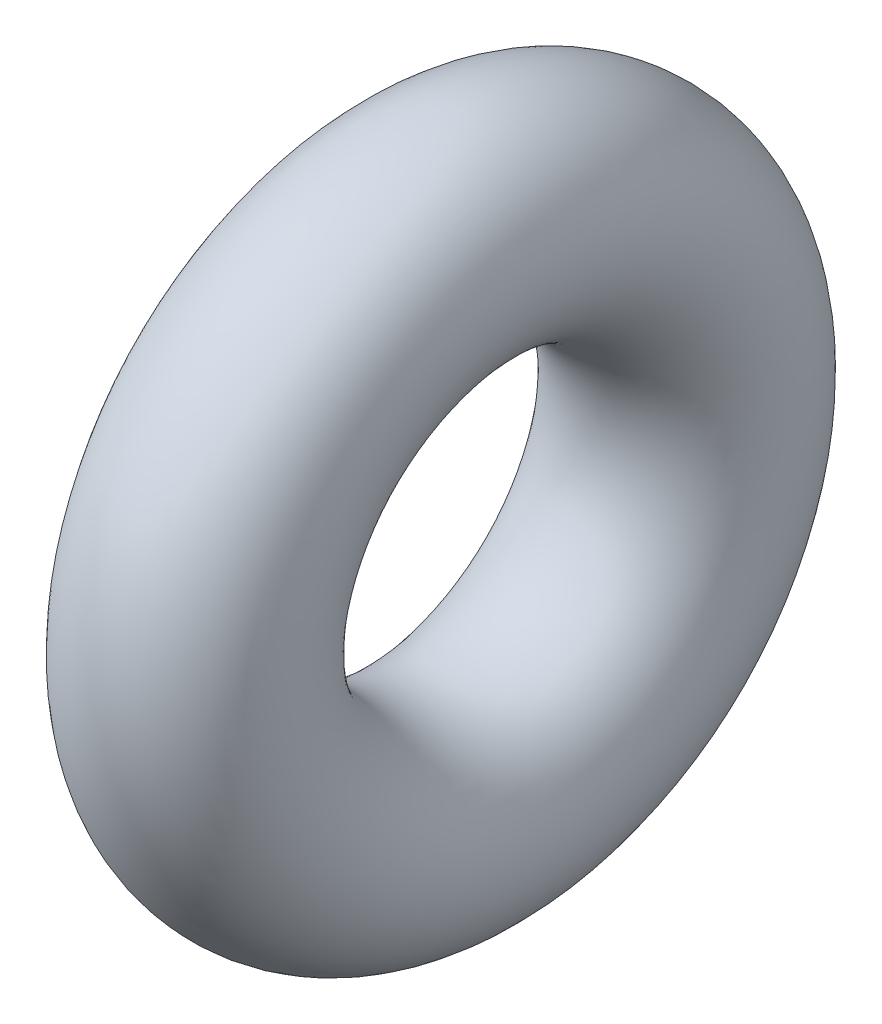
ISO-10303-21;
HEADER;
FILE_DESCRIPTION(('STEP AP214'),'2;1');
FILE_NAME('part.step','',(''),(''),'','','');
FILE_SCHEMA(('AUTOMOTIVE_DESIGN { 1 0 10303 214 1 1 1 1 }'));
ENDSEC;
DATA;
#1=APPLICATION_CONTEXT('core data for automotive mechanical design processes');
#2=APPLICATION_PROTOCOL_DEFINITION('international standard','automotive_design',2000,#1);
#3=PRODUCT_CONTEXT('',#1,'mechanical');
#4=PRODUCT('Part','Part','',(#3));
#5=PRODUCT_RELATED_PRODUCT_CATEGORY('part','',(#4));
#6=PRODUCT_DEFINITION_FORMATION('','',#4);
#7=PRODUCT_DEFINITION_CONTEXT('part definition',#1,'design');
#8=PRODUCT_DEFINITION('design','',#6,#7);
#9=PRODUCT_DEFINITION_SHAPE('','',#8);
#10=(LENGTH_UNIT() NAMED_UNIT(*) SI_UNIT(.MILLI.,.METRE.));
#11=(NAMED_UNIT(*) PLANE_ANGLE_UNIT() SI_UNIT($,.RADIAN.));
#12=(NAMED_UNIT(*) SI_UNIT($,.STERADIAN.) SOLID_ANGLE_UNIT());
#13=UNCERTAINTY_MEASURE_WITH_UNIT(LENGTH_MEASURE(1.E-05),#10,'distance_accuracy_value','');
#14=(GEOMETRIC_REPRESENTATION_CONTEXT(3) GLOBAL_UNCERTAINTY_ASSIGNED_CONTEXT((#13)) GLOBAL_UNIT_ASSIGNED_CONTEXT((#10,
#11,#12)) REPRESENTATION_CONTEXT('',''));
#15=CARTESIAN_POINT('',(0.,0.,0.));
#16=DIRECTION('',(0.,0.,1.));
#17=DIRECTION('',(1.,0.,0.));
#18=AXIS2_PLACEMENT_3D('',#15,#16,#17);
#19=CARTESIAN_POINT('',(0.,0.,0.));
#20=DIRECTION('',(1.,0.,0.));
#21=DIRECTION('',(0.,0.,-1.));
#22=AXIS2_PLACEMENT_3D('',#19,#20,#21);
#23=TOROIDAL_SURFACE('',#22,4.1275,1.7653);
#24=CARTESIAN_POINT('',(0.,0.,-5.8928));
#25=VERTEX_POINT('',#24);
#26=VERTEX_LOOP('',#25);
#27=FACE_BOUND('',#26,.T.);
#28=ADVANCED_FACE('F28',(#27),#23,.T.);
#29=CLOSED_SHELL('',(#28));
#30=MANIFOLD_SOLID_BREP('B2',#29);
#31=ADVANCED_BREP_SHAPE_REPRESENTATION('',(#18,#30),#14);
#32=SHAPE_DEFINITION_REPRESENTATION(#9,#31);
ENDSEC;
END-ISO-10303-21;
